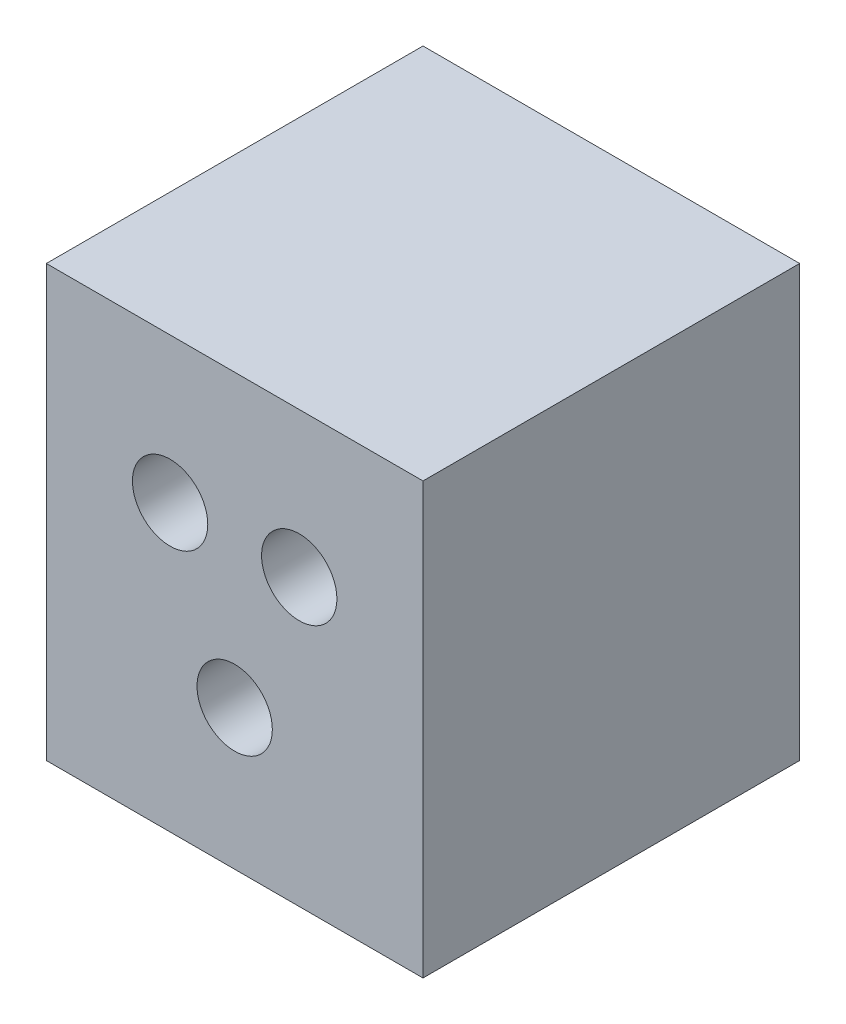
from build123d import *

# Parameters (mm, degrees)
ESQUISSE1_W               = 35
ESQUISSE1_H               = 40
EXTRUSION1_DEPTH          = 35
TROU_TARAUD_M8X1_01_D     = 7
TROU_TARAUD_M8X1_01_DEPTH = 19
TROU_TARAUD_M8X1_01_TIP   = 2.103012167


with BuildPart() as part:
    # Esquisse1 → Extrusion1 (new body)
    with BuildSketch(Plane.XY):
        with Locations((17.5, 20)):
            Rectangle(ESQUISSE1_W, ESQUISSE1_H)
    extrude(amount=EXTRUSION1_DEPTH)

    # Trou taraud_ M8x1.01
    with Locations(Plane.XY.offset(35)):
        with Locations((11.5, 26.5), (23.5, 26.5), (17.5, 13)):
            Hole(TROU_TARAUD_M8X1_01_D / 2, depth=TROU_TARAUD_M8X1_01_DEPTH)
            with Locations((0, 0, -(TROU_TARAUD_M8X1_01_DEPTH + TROU_TARAUD_M8X1_01_TIP / 2))):  # 118° drill point
                Cone(0, TROU_TARAUD_M8X1_01_D / 2, TROU_TARAUD_M8X1_01_TIP, mode=Mode.SUBTRACT)


solid = part.part
